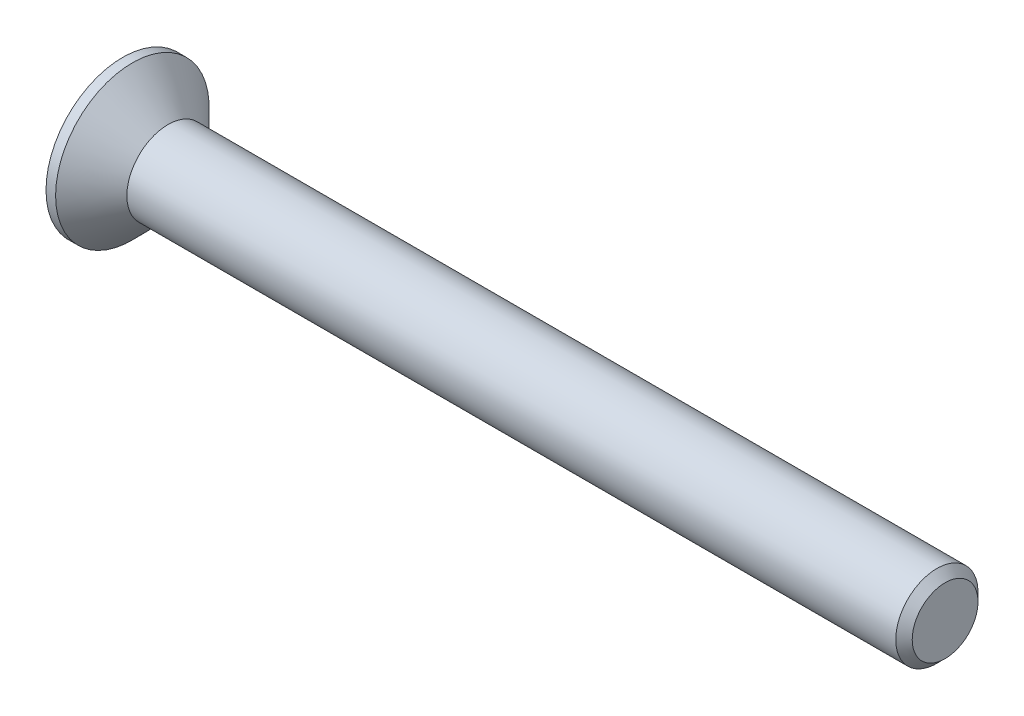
from build123d import *

# Parameters (mm, degrees)
CHAMFER1_SIZE      = 0.3
CUT_EXTRUDE1_DEPTH = 1.25


with BuildPart() as part:
    # Sketch1 → Revolve1 (revolve)
    with BuildSketch(Plane.XY, mode=Mode.PRIVATE) as revolve1_sk:
        Polygon((-1.65, 2.8), (-1.65, 0), (28.35, 0), (28.35, 1.5), (0, 1.5), (-1.3, 2.8), align=None)
    revolve(revolve1_sk.sketch.rotate(Axis((-1.65, 0, 0), (1, 0, 0)), 90), axis=Axis((-1.65, 0, 0), (1, 0, 0)))

    # Chamfer1
    chamfer1_edges = [part.edges().sort_by_distance(p)[0] for p in [
        (28.35, 0, -1.5),
    ]]
    chamfer(chamfer1_edges, length=CHAMFER1_SIZE)

    # Sketch2 → Cut-Extrude1 (cut)
    with BuildSketch(Plane.ZY.offset(1.65)):
        Polygon((-0.365, 1.45), (0.365, 1.45), (0.365, 0.365), (1.45, 0.365), (1.45, -0.365), (0.365, -0.365), (0.365, -1.45), (-0.365, -1.45), (-0.365, -0.365), (-1.45, -0.365), (-1.45, 0.365), (-0.365, 0.365), align=None)
    extrude(amount=-CUT_EXTRUDE1_DEPTH, mode=Mode.SUBTRACT)


solid = part.part
